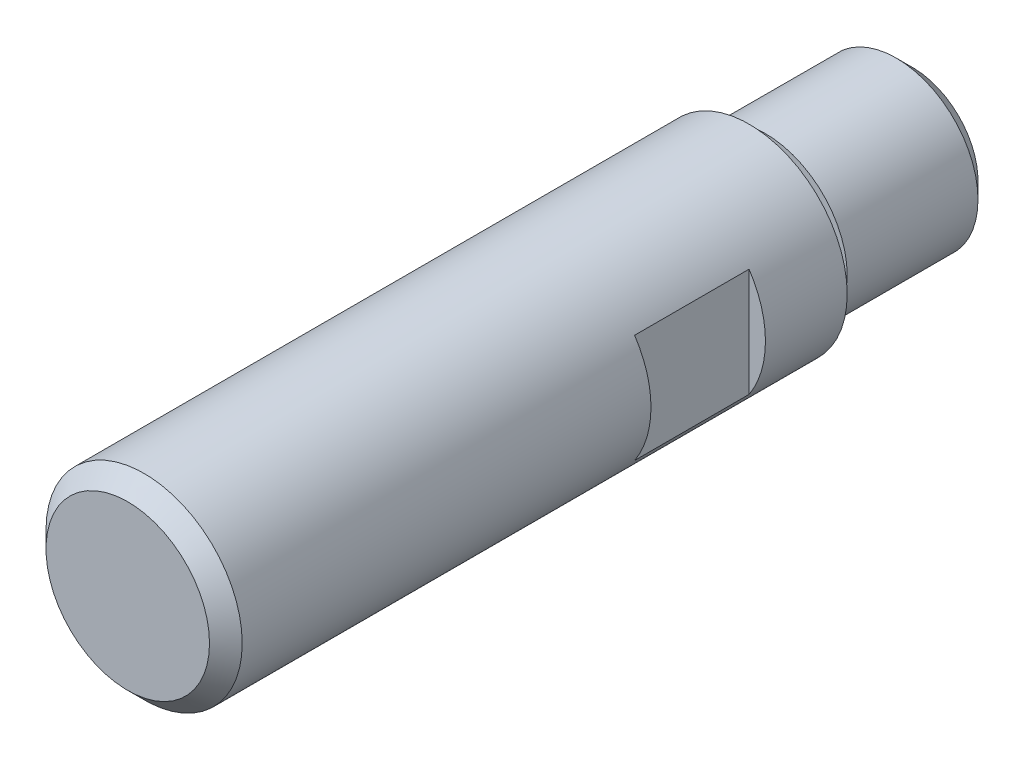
from build123d import *

# Parameters (mm, degrees)
ESQUISSE1_R             = 6
BASE_EXTRUSION_DEPTH    = 38
CHANFREIN1_SIZE         = 1
ESQUISSE3_R             = 5
BOSS_EXTRU_1_DEPTH      = 10
ESQUISSE4_R             = 5
BOSS_EXTRU_2_DEPTH      = 10
CHANFREIN2_SIZE         = 1
ESQUISSE5_W             = 0.75
ESQUISSE5_H             = 1
ESQUISSE7_W             = 7.258177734
ESQUISSE7_H             = 7
ESQUISSE7_W_2           = 15.887344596
ENL_V_MAT_EXTRU_1_DEPTH = 9


with BuildPart() as part:
    # Esquisse1 → Base-Extrusion (new body)
    with BuildSketch(Plane.XY):
        Circle(ESQUISSE1_R)
    extrude(amount=-BASE_EXTRUSION_DEPTH)

    # Chanfrein1
    chanfrein1_edges = [part.edges().sort_by_distance(p)[0] for p in [
        (-6, 0, 0),
    ]]
    chamfer(chanfrein1_edges, length=CHANFREIN1_SIZE)

    # Esquisse3 → Boss.-Extru.1 (add)
    with BuildSketch(Plane(origin=(0, 0, -38), x_dir=(-1, 0, 0), z_dir=(0, 0, -1))):
        Circle(ESQUISSE3_R)
    extrude(amount=-BOSS_EXTRU_1_DEPTH)

    # Esquisse4 → Boss.-Extru.2 (add)
    with BuildSketch(Plane(origin=(0, 0, -38), x_dir=(-1, 0, 0), z_dir=(0, 0, -1))):
        with Locations(Location((0, 0, 0), (0, 0, 180))):
            Circle(ESQUISSE4_R)
    extrude(amount=BOSS_EXTRU_2_DEPTH)

    # Chanfrein2
    chanfrein2_edges = [part.edges().sort_by_distance(p)[0] for p in [
        (-5, 0, -48),
    ]]
    chamfer(chanfrein2_edges, length=CHANFREIN2_SIZE)

    # Esquisse5 → Enl_vement de mati_re-R_volution2 (revolve, cut)
    with BuildSketch(Plane(origin=(0, 0, 0), x_dir=(1, 0, 0), z_dir=(0, 1, 0)), mode=Mode.PRIVATE) as enl_vement_de_mati_re_r_volution2_sk:
        with Locations((-4.65487729, 38.5)):
            Rectangle(ESQUISSE5_W, ESQUISSE5_H)
    revolve(enl_vement_de_mati_re_r_volution2_sk.sketch.rotate(Axis((0, 0, 0), (0, 0, -1)), 180), axis=Axis((0, 0, 0), (0, 0, -1)), mode=Mode.SUBTRACT)

    # Esquisse7 → Enl_v. mat.-Extru.1 (cut, symmetric)
    with BuildSketch(Plane(origin=(0, 0, 0), x_dir=(1, 0, 0), z_dir=(0, 1, 0))):
        with Locations((8.629088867, 29.5)):
            Rectangle(ESQUISSE7_W, ESQUISSE7_H)
        with Locations((-12.943672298, 29.5)):
            Rectangle(ESQUISSE7_W_2, ESQUISSE7_H)
    extrude(amount=ENL_V_MAT_EXTRU_1_DEPTH, both=True, mode=Mode.SUBTRACT)


solid = part.part
